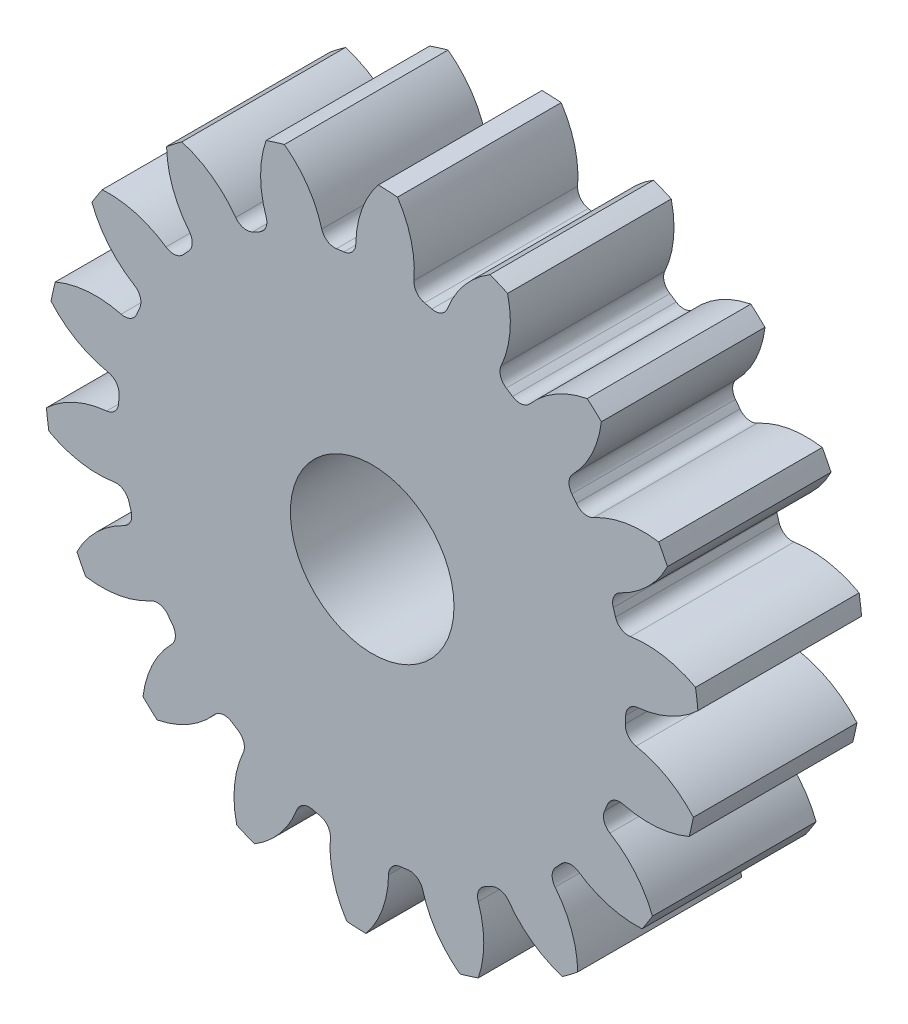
from build123d import *

# Parameters (mm, degrees)
SKETCH3_R         = 203.2
GEARBODY_DEPTH    = 101.6
TOOTHCUT_DEPTH    = 305.8
CIRPATTERN1_COUNT = 18
BOREDIA_R         = 50.8
BORE_DEPTH        = 12700


with BuildPart() as part:
    # Sketch3 → gearBody (new body)
    with BuildSketch(Plane.XY):
        Circle(SKETCH3_R)
    extrude(amount=GEARBODY_DEPTH)

    # Sketch2 → toothCut (cut, through all)
    with BuildSketch(Plane.XY):
        with BuildLine():
            ThreePointArc((157.167111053, -9.922177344), (157.296847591, -7.5929005), (157.392065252, -5.26195739))
            ThreePointArc((157.392065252, -5.26195739), (159.628792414, 0.122914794), (164.862457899, 2.693623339))
            ThreePointArc((164.862457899, 2.693623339), (185.568738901, 8.346164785), (203.2, 20.587076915))
            ThreePointArc((203.2, 20.587076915), (204.002685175, -9.847445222), (200.272343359, -40.063152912))
            ThreePointArc((200.272343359, -40.063152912), (183.902075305, -26.1809477), (163.836506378, -18.560301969))
            ThreePointArc((163.836506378, -18.560301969), (158.874779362, -15.497450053), (157.167111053, -9.922177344))
        make_face()
    toothcut = extrude(amount=TOOTHCUT_DEPTH, mode=Mode.SUBTRACT)

    # CirPattern1: toothCut ×18 about axis
    cirpattern1_axis = Axis((0, 0, 0), (0, 0, 1))
    for i in range(1, CIRPATTERN1_COUNT):
        add(toothcut.rotate(cirpattern1_axis, i * 360 / CIRPATTERN1_COUNT), mode=Mode.SUBTRACT)

    # boreDia → bore (cut, symmetric)
    with BuildSketch(Plane.XY):
        Circle(BOREDIA_R)
    extrude(amount=BORE_DEPTH, both=True, mode=Mode.SUBTRACT)


solid = part.part
